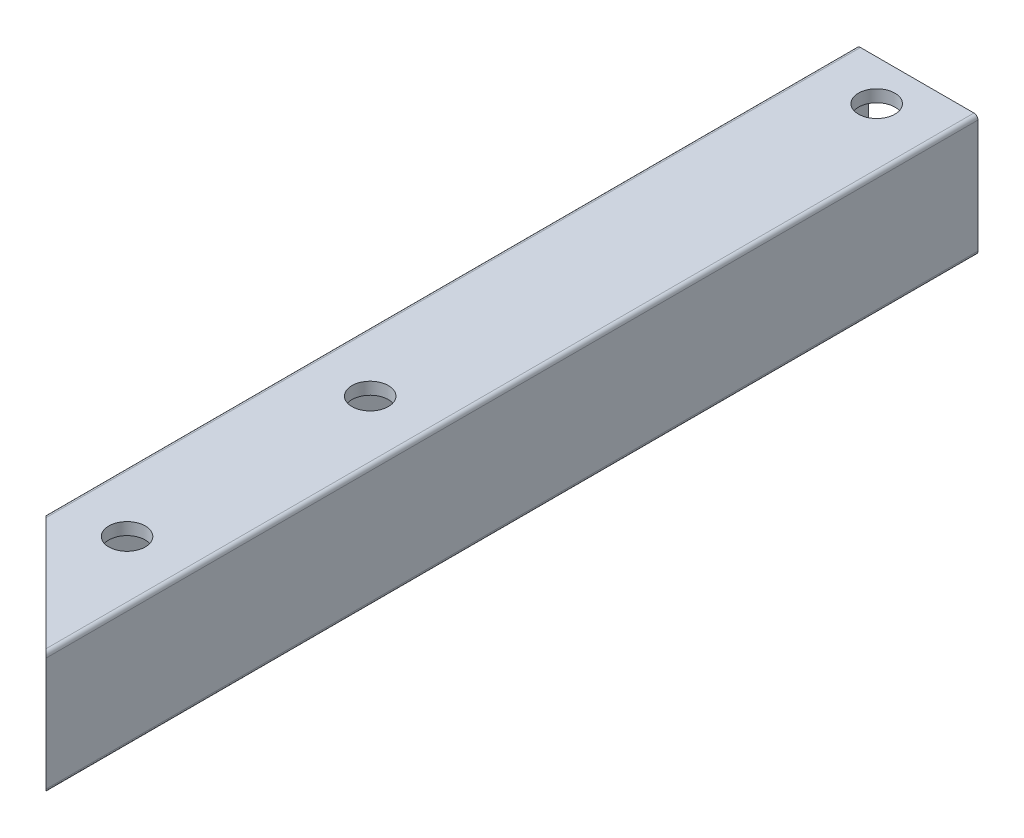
ISO-10303-21;
HEADER;
FILE_DESCRIPTION(('STEP AP214'),'2;1');
FILE_NAME('part.step','',(''),(''),'','','');
FILE_SCHEMA(('AUTOMOTIVE_DESIGN { 1 0 10303 214 1 1 1 1 }'));
ENDSEC;
DATA;
#1=APPLICATION_CONTEXT('core data for automotive mechanical design processes');
#2=APPLICATION_PROTOCOL_DEFINITION('international standard','automotive_design',2000,#1);
#3=PRODUCT_CONTEXT('',#1,'mechanical');
#4=PRODUCT('Part','Part','',(#3));
#5=PRODUCT_RELATED_PRODUCT_CATEGORY('part','',(#4));
#6=PRODUCT_DEFINITION_FORMATION('','',#4);
#7=PRODUCT_DEFINITION_CONTEXT('part definition',#1,'design');
#8=PRODUCT_DEFINITION('design','',#6,#7);
#9=PRODUCT_DEFINITION_SHAPE('','',#8);
#10=(LENGTH_UNIT() NAMED_UNIT(*) SI_UNIT(.MILLI.,.METRE.));
#11=(NAMED_UNIT(*) PLANE_ANGLE_UNIT() SI_UNIT($,.RADIAN.));
#12=(NAMED_UNIT(*) SI_UNIT($,.STERADIAN.) SOLID_ANGLE_UNIT());
#13=UNCERTAINTY_MEASURE_WITH_UNIT(LENGTH_MEASURE(1.E-05),#10,'distance_accuracy_value','');
#14=(GEOMETRIC_REPRESENTATION_CONTEXT(3) GLOBAL_UNCERTAINTY_ASSIGNED_CONTEXT((#13)) GLOBAL_UNIT_ASSIGNED_CONTEXT((#10,
#11,#12)) REPRESENTATION_CONTEXT('',''));
#15=CARTESIAN_POINT('',(0.,0.,0.));
#16=DIRECTION('',(0.,0.,1.));
#17=DIRECTION('',(1.,0.,0.));
#18=AXIS2_PLACEMENT_3D('',#15,#16,#17);
#19=CARTESIAN_POINT('',(-14.,-14.,230.));
#20=DIRECTION('',(0.,0.,-1.));
#21=DIRECTION('',(-1.,0.,0.));
#22=AXIS2_PLACEMENT_3D('',#19,#20,#21);
#23=CYLINDRICAL_SURFACE('',#22,0.999999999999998);
#24=CARTESIAN_POINT('',(-14.,-14.,201.));
#25=DIRECTION('',(0.707106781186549,0.,-0.707106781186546));
#26=DIRECTION('',(-0.707106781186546,0.,-0.707106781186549));
#27=AXIS2_PLACEMENT_3D('',#24,#25,#26);
#28=ELLIPSE('',#27,1.4142135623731,0.999999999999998);
#29=CARTESIAN_POINT('',(-15.,-14.,200.));
#30=VERTEX_POINT('',#29);
#31=CARTESIAN_POINT('',(-14.,-15.,201.));
#32=VERTEX_POINT('',#31);
#33=EDGE_CURVE('E117',#30,#32,#28,.F.);
#34=ORIENTED_EDGE('',*,*,#33,.F.);
#35=DIRECTION('',(0.,0.,-1.));
#36=VECTOR('',#35,1.);
#37=CARTESIAN_POINT('',(-15.,-14.,230.));
#38=LINE('',#37,#36);
#39=CARTESIAN_POINT('',(-15.,-14.,0.));
#40=VERTEX_POINT('',#39);
#41=EDGE_CURVE('E157',#30,#40,#38,.T.);
#42=ORIENTED_EDGE('',*,*,#41,.T.);
#43=CARTESIAN_POINT('',(-14.,-14.,0.));
#44=DIRECTION('',(0.,0.,-1.));
#45=DIRECTION('',(-1.,0.,0.));
#46=AXIS2_PLACEMENT_3D('',#43,#44,#45);
#47=CIRCLE('',#46,0.999999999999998);
#48=CARTESIAN_POINT('',(-14.,-15.,0.));
#49=VERTEX_POINT('',#48);
#50=EDGE_CURVE('E138',#49,#40,#47,.T.);
#51=ORIENTED_EDGE('',*,*,#50,.F.);
#52=DIRECTION('',(0.,0.,-1.));
#53=VECTOR('',#52,1.);
#54=CARTESIAN_POINT('',(-14.,-15.,230.));
#55=LINE('',#54,#53);
#56=EDGE_CURVE('E38',#32,#49,#55,.T.);
#57=ORIENTED_EDGE('',*,*,#56,.F.);
#58=EDGE_LOOP('',(#34,#42,#51,#57));
#59=FACE_BOUND('',#58,.T.);
#60=ADVANCED_FACE('F30',(#59),#23,.T.);
#61=CARTESIAN_POINT('',(14.,-15.,230.));
#62=DIRECTION('',(0.,-1.,0.));
#63=DIRECTION('',(1.,0.,0.));
#64=AXIS2_PLACEMENT_3D('',#61,#62,#63);
#65=PLANE('',#64);
#66=CARTESIAN_POINT('',(0.,-15.,10.));
#67=DIRECTION('',(0.,1.,0.));
#68=DIRECTION('',(0.,0.,1.));
#69=AXIS2_PLACEMENT_3D('',#66,#67,#68);
#70=CIRCLE('',#69,4.5);
#71=CARTESIAN_POINT('',(0.,-15.,14.5));
#72=VERTEX_POINT('',#71);
#73=EDGE_CURVE('E477',#72,#72,#70,.T.);
#74=ORIENTED_EDGE('',*,*,#73,.T.);
#75=EDGE_LOOP('',(#74));
#76=FACE_BOUND('',#75,.T.);
#77=CARTESIAN_POINT('',(0.,-15.,135.));
#78=DIRECTION('',(0.,-1.,0.));
#79=DIRECTION('',(1.,0.,0.));
#80=AXIS2_PLACEMENT_3D('',#77,#78,#79);
#81=CIRCLE('',#80,4.5);
#82=CARTESIAN_POINT('',(4.5,-15.,135.));
#83=VERTEX_POINT('',#82);
#84=EDGE_CURVE('E172',#83,#83,#81,.T.);
#85=ORIENTED_EDGE('',*,*,#84,.F.);
#86=EDGE_LOOP('',(#85));
#87=FACE_BOUND('',#86,.T.);
#88=CARTESIAN_POINT('',(0.,-15.,195.));
#89=DIRECTION('',(0.,-1.,0.));
#90=DIRECTION('',(1.,0.,0.));
#91=AXIS2_PLACEMENT_3D('',#88,#89,#90);
#92=CIRCLE('',#91,4.5);
#93=CARTESIAN_POINT('',(4.5,-15.,195.));
#94=VERTEX_POINT('',#93);
#95=EDGE_CURVE('E169',#94,#94,#92,.T.);
#96=ORIENTED_EDGE('',*,*,#95,.F.);
#97=EDGE_LOOP('',(#96));
#98=FACE_BOUND('',#97,.T.);
#99=DIRECTION('',(0.707106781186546,0.,0.707106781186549));
#100=VECTOR('',#99,1.);
#101=CARTESIAN_POINT('',(17.5,-15.,232.5));
#102=LINE('',#101,#100);
#103=CARTESIAN_POINT('',(14.,-15.,229.));
#104=VERTEX_POINT('',#103);
#105=EDGE_CURVE('E120',#32,#104,#102,.T.);
#106=ORIENTED_EDGE('',*,*,#105,.F.);
#107=ORIENTED_EDGE('',*,*,#56,.T.);
#108=DIRECTION('',(-1.,0.,0.));
#109=VECTOR('',#108,1.);
#110=CARTESIAN_POINT('',(14.,-15.,0.));
#111=LINE('',#110,#109);
#112=CARTESIAN_POINT('',(14.,-15.,0.));
#113=VERTEX_POINT('',#112);
#114=EDGE_CURVE('E238',#113,#49,#111,.T.);
#115=ORIENTED_EDGE('',*,*,#114,.F.);
#116=DIRECTION('',(0.,0.,-1.));
#117=VECTOR('',#116,1.);
#118=CARTESIAN_POINT('',(14.,-15.,230.));
#119=LINE('',#118,#117);
#120=EDGE_CURVE('E133',#104,#113,#119,.T.);
#121=ORIENTED_EDGE('',*,*,#120,.F.);
#122=EDGE_LOOP('',(#106,#107,#115,#121));
#123=FACE_BOUND('',#122,.T.);
#124=ADVANCED_FACE('F130',(#76,#87,#98,#123),#65,.T.);
#125=CARTESIAN_POINT('',(14.,-14.,230.));
#126=DIRECTION('',(0.,0.,-1.));
#127=DIRECTION('',(-1.,0.,0.));
#128=AXIS2_PLACEMENT_3D('',#125,#126,#127);
#129=CYLINDRICAL_SURFACE('',#128,1.);
#130=CARTESIAN_POINT('',(14.,-14.,229.));
#131=DIRECTION('',(0.707106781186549,0.,-0.707106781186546));
#132=DIRECTION('',(-0.707106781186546,0.,-0.707106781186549));
#133=AXIS2_PLACEMENT_3D('',#130,#131,#132);
#134=ELLIPSE('',#133,1.4142135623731,1.);
#135=CARTESIAN_POINT('',(15.,-14.,230.));
#136=VERTEX_POINT('',#135);
#137=EDGE_CURVE('E199',#104,#136,#134,.F.);
#138=ORIENTED_EDGE('',*,*,#137,.F.);
#139=ORIENTED_EDGE('',*,*,#120,.T.);
#140=CARTESIAN_POINT('',(14.,-14.,0.));
#141=DIRECTION('',(0.,0.,-1.));
#142=DIRECTION('',(-1.,0.,0.));
#143=AXIS2_PLACEMENT_3D('',#140,#141,#142);
#144=CIRCLE('',#143,1.);
#145=CARTESIAN_POINT('',(15.,-14.,0.));
#146=VERTEX_POINT('',#145);
#147=EDGE_CURVE('E236',#146,#113,#144,.T.);
#148=ORIENTED_EDGE('',*,*,#147,.F.);
#149=DIRECTION('',(0.,0.,-1.));
#150=VECTOR('',#149,1.);
#151=CARTESIAN_POINT('',(15.,-14.,230.));
#152=LINE('',#151,#150);
#153=EDGE_CURVE('E141',#136,#146,#152,.T.);
#154=ORIENTED_EDGE('',*,*,#153,.F.);
#155=EDGE_LOOP('',(#138,#139,#148,#154));
#156=FACE_BOUND('',#155,.T.);
#157=ADVANCED_FACE('F253',(#156),#129,.T.);
#158=CARTESIAN_POINT('',(15.,-14.,230.));
#159=DIRECTION('',(-1.,0.,0.));
#160=DIRECTION('',(0.,-1.,0.));
#161=AXIS2_PLACEMENT_3D('',#158,#159,#160);
#162=PLANE('',#161);
#163=DIRECTION('',(0.,1.,0.));
#164=VECTOR('',#163,1.);
#165=CARTESIAN_POINT('',(15.,-14.,0.));
#166=LINE('',#165,#164);
#167=CARTESIAN_POINT('',(15.,14.,0.));
#168=VERTEX_POINT('',#167);
#169=EDGE_CURVE('E234',#146,#168,#166,.T.);
#170=ORIENTED_EDGE('',*,*,#169,.T.);
#171=DIRECTION('',(0.,0.,-1.));
#172=VECTOR('',#171,1.);
#173=CARTESIAN_POINT('',(15.,14.,230.));
#174=LINE('',#173,#172);
#175=CARTESIAN_POINT('',(15.,14.,230.));
#176=VERTEX_POINT('',#175);
#177=EDGE_CURVE('E148',#176,#168,#174,.T.);
#178=ORIENTED_EDGE('',*,*,#177,.F.);
#179=DIRECTION('',(0.,1.,0.));
#180=VECTOR('',#179,1.);
#181=CARTESIAN_POINT('',(15.,-14.,230.));
#182=LINE('',#181,#180);
#183=EDGE_CURVE('E144',#136,#176,#182,.T.);
#184=ORIENTED_EDGE('',*,*,#183,.F.);
#185=ORIENTED_EDGE('',*,*,#153,.T.);
#186=EDGE_LOOP('',(#170,#178,#184,#185));
#187=FACE_BOUND('',#186,.T.);
#188=ADVANCED_FACE('F248',(#187),#162,.F.);
#189=CARTESIAN_POINT('',(14.,14.,230.));
#190=DIRECTION('',(0.,0.,-1.));
#191=DIRECTION('',(-1.,0.,0.));
#192=AXIS2_PLACEMENT_3D('',#189,#190,#191);
#193=CYLINDRICAL_SURFACE('',#192,0.999999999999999);
#194=DIRECTION('',(0.,0.,-1.));
#195=VECTOR('',#194,1.);
#196=CARTESIAN_POINT('',(14.,15.,230.));
#197=LINE('',#196,#195);
#198=CARTESIAN_POINT('',(14.,15.,229.));
#199=VERTEX_POINT('',#198);
#200=CARTESIAN_POINT('',(14.,15.,0.));
#201=VERTEX_POINT('',#200);
#202=EDGE_CURVE('E151',#199,#201,#197,.T.);
#203=ORIENTED_EDGE('',*,*,#202,.F.);
#204=CARTESIAN_POINT('',(14.,14.,229.));
#205=DIRECTION('',(0.707106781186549,0.,-0.707106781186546));
#206=DIRECTION('',(-0.707106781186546,0.,-0.707106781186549));
#207=AXIS2_PLACEMENT_3D('',#204,#205,#206);
#208=ELLIPSE('',#207,1.4142135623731,0.999999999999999);
#209=EDGE_CURVE('E126',#199,#176,#208,.T.);
#210=ORIENTED_EDGE('',*,*,#209,.T.);
#211=ORIENTED_EDGE('',*,*,#177,.T.);
#212=CARTESIAN_POINT('',(14.,14.,0.));
#213=DIRECTION('',(0.,0.,1.));
#214=DIRECTION('',(1.,0.,0.));
#215=AXIS2_PLACEMENT_3D('',#212,#213,#214);
#216=CIRCLE('',#215,0.999999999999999);
#217=EDGE_CURVE('E231',#168,#201,#216,.T.);
#218=ORIENTED_EDGE('',*,*,#217,.T.);
#219=EDGE_LOOP('',(#203,#210,#211,#218));
#220=FACE_BOUND('',#219,.T.);
#221=ADVANCED_FACE('F246',(#220),#193,.T.);
#222=CARTESIAN_POINT('',(-14.,15.,230.));
#223=DIRECTION('',(0.,1.,0.));
#224=DIRECTION('',(0.,0.,1.));
#225=AXIS2_PLACEMENT_3D('',#222,#223,#224);
#226=PLANE('',#225);
#227=CARTESIAN_POINT('',(0.,15.,10.));
#228=DIRECTION('',(0.,1.,0.));
#229=DIRECTION('',(0.,0.,1.));
#230=AXIS2_PLACEMENT_3D('',#227,#228,#229);
#231=CIRCLE('',#230,4.5);
#232=CARTESIAN_POINT('',(0.,15.,14.5));
#233=VERTEX_POINT('',#232);
#234=EDGE_CURVE('E483',#233,#233,#231,.T.);
#235=ORIENTED_EDGE('',*,*,#234,.F.);
#236=EDGE_LOOP('',(#235));
#237=FACE_BOUND('',#236,.T.);
#238=CARTESIAN_POINT('',(0.,15.,135.));
#239=DIRECTION('',(0.,-1.,0.));
#240=DIRECTION('',(1.,0.,0.));
#241=AXIS2_PLACEMENT_3D('',#238,#239,#240);
#242=CIRCLE('',#241,4.5);
#243=CARTESIAN_POINT('',(4.5,15.,135.));
#244=VERTEX_POINT('',#243);
#245=EDGE_CURVE('E165',#244,#244,#242,.T.);
#246=ORIENTED_EDGE('',*,*,#245,.T.);
#247=EDGE_LOOP('',(#246));
#248=FACE_BOUND('',#247,.T.);
#249=CARTESIAN_POINT('',(0.,15.,195.));
#250=DIRECTION('',(0.,-1.,0.));
#251=DIRECTION('',(1.,0.,0.));
#252=AXIS2_PLACEMENT_3D('',#249,#250,#251);
#253=CIRCLE('',#252,4.5);
#254=CARTESIAN_POINT('',(4.5,15.,195.));
#255=VERTEX_POINT('',#254);
#256=EDGE_CURVE('E161',#255,#255,#253,.T.);
#257=ORIENTED_EDGE('',*,*,#256,.T.);
#258=EDGE_LOOP('',(#257));
#259=FACE_BOUND('',#258,.T.);
#260=DIRECTION('',(0.707106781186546,0.,0.707106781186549));
#261=VECTOR('',#260,1.);
#262=CARTESIAN_POINT('',(17.5,15.,232.5));
#263=LINE('',#262,#261);
#264=CARTESIAN_POINT('',(-14.,15.,201.));
#265=VERTEX_POINT('',#264);
#266=EDGE_CURVE('E134',#265,#199,#263,.T.);
#267=ORIENTED_EDGE('',*,*,#266,.T.);
#268=ORIENTED_EDGE('',*,*,#202,.T.);
#269=DIRECTION('',(1.,0.,0.));
#270=VECTOR('',#269,1.);
#271=CARTESIAN_POINT('',(-14.,15.,0.));
#272=LINE('',#271,#270);
#273=CARTESIAN_POINT('',(-14.,15.,0.));
#274=VERTEX_POINT('',#273);
#275=EDGE_CURVE('E228',#274,#201,#272,.T.);
#276=ORIENTED_EDGE('',*,*,#275,.F.);
#277=DIRECTION('',(0.,0.,-1.));
#278=VECTOR('',#277,1.);
#279=CARTESIAN_POINT('',(-14.,15.,230.));
#280=LINE('',#279,#278);
#281=EDGE_CURVE('E153',#265,#274,#280,.T.);
#282=ORIENTED_EDGE('',*,*,#281,.F.);
#283=EDGE_LOOP('',(#267,#268,#276,#282));
#284=FACE_BOUND('',#283,.T.);
#285=ADVANCED_FACE('F283',(#237,#248,#259,#284),#226,.T.);
#286=CARTESIAN_POINT('',(-14.,14.,230.));
#287=DIRECTION('',(0.,0.,-1.));
#288=DIRECTION('',(-1.,0.,0.));
#289=AXIS2_PLACEMENT_3D('',#286,#287,#288);
#290=CYLINDRICAL_SURFACE('',#289,0.999999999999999);
#291=CARTESIAN_POINT('',(-14.,14.,201.));
#292=DIRECTION('',(0.707106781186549,0.,-0.707106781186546));
#293=DIRECTION('',(-0.707106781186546,0.,-0.707106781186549));
#294=AXIS2_PLACEMENT_3D('',#291,#292,#293);
#295=ELLIPSE('',#294,1.4142135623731,0.999999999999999);
#296=CARTESIAN_POINT('',(-15.,14.,200.));
#297=VERTEX_POINT('',#296);
#298=EDGE_CURVE('E46',#265,#297,#295,.F.);
#299=ORIENTED_EDGE('',*,*,#298,.F.);
#300=ORIENTED_EDGE('',*,*,#281,.T.);
#301=CARTESIAN_POINT('',(-14.,14.,0.));
#302=DIRECTION('',(0.,0.,-1.));
#303=DIRECTION('',(-1.,0.,0.));
#304=AXIS2_PLACEMENT_3D('',#301,#302,#303);
#305=CIRCLE('',#304,0.999999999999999);
#306=CARTESIAN_POINT('',(-15.,14.,0.));
#307=VERTEX_POINT('',#306);
#308=EDGE_CURVE('E225',#307,#274,#305,.T.);
#309=ORIENTED_EDGE('',*,*,#308,.F.);
#310=DIRECTION('',(0.,0.,-1.));
#311=VECTOR('',#310,1.);
#312=CARTESIAN_POINT('',(-15.,14.,230.));
#313=LINE('',#312,#311);
#314=EDGE_CURVE('E155',#297,#307,#313,.T.);
#315=ORIENTED_EDGE('',*,*,#314,.F.);
#316=EDGE_LOOP('',(#299,#300,#309,#315));
#317=FACE_BOUND('',#316,.T.);
#318=ADVANCED_FACE('F288',(#317),#290,.T.);
#319=CARTESIAN_POINT('',(-15.,14.,230.));
#320=DIRECTION('',(1.,0.,0.));
#321=DIRECTION('',(0.,1.,0.));
#322=AXIS2_PLACEMENT_3D('',#319,#320,#321);
#323=PLANE('',#322);
#324=ORIENTED_EDGE('',*,*,#41,.F.);
#325=DIRECTION('',(0.,1.,0.));
#326=VECTOR('',#325,1.);
#327=CARTESIAN_POINT('',(-15.,14.,200.));
#328=LINE('',#327,#326);
#329=EDGE_CURVE('E122',#30,#297,#328,.T.);
#330=ORIENTED_EDGE('',*,*,#329,.T.);
#331=ORIENTED_EDGE('',*,*,#314,.T.);
#332=DIRECTION('',(0.,-1.,0.));
#333=VECTOR('',#332,1.);
#334=CARTESIAN_POINT('',(-15.,14.,0.));
#335=LINE('',#334,#333);
#336=EDGE_CURVE('E222',#307,#40,#335,.T.);
#337=ORIENTED_EDGE('',*,*,#336,.T.);
#338=EDGE_LOOP('',(#324,#330,#331,#337));
#339=FACE_BOUND('',#338,.T.);
#340=ADVANCED_FACE('F361',(#339),#323,.F.);
#341=CARTESIAN_POINT('',(-14.,-14.,0.));
#342=DIRECTION('',(0.,0.,-1.));
#343=DIRECTION('',(-1.,0.,0.));
#344=AXIS2_PLACEMENT_3D('',#341,#342,#343);
#345=PLANE('',#344);
#346=DIRECTION('',(-1.,0.,0.));
#347=VECTOR('',#346,1.);
#348=CARTESIAN_POINT('',(-14.,-12.,0.));
#349=LINE('',#348,#347);
#350=CARTESIAN_POINT('',(12.,-12.,0.));
#351=VERTEX_POINT('',#350);
#352=CARTESIAN_POINT('',(-12.,-12.,0.));
#353=VERTEX_POINT('',#352);
#354=EDGE_CURVE('E204',#351,#353,#349,.T.);
#355=ORIENTED_EDGE('',*,*,#354,.F.);
#356=DIRECTION('',(0.,1.,0.));
#357=VECTOR('',#356,1.);
#358=CARTESIAN_POINT('',(12.,-14.,0.));
#359=LINE('',#358,#357);
#360=CARTESIAN_POINT('',(12.,12.,0.));
#361=VERTEX_POINT('',#360);
#362=EDGE_CURVE('E207',#351,#361,#359,.T.);
#363=ORIENTED_EDGE('',*,*,#362,.T.);
#364=DIRECTION('',(1.,0.,0.));
#365=VECTOR('',#364,1.);
#366=CARTESIAN_POINT('',(-14.,12.,0.));
#367=LINE('',#366,#365);
#368=CARTESIAN_POINT('',(-12.,12.,0.));
#369=VERTEX_POINT('',#368);
#370=EDGE_CURVE('E210',#369,#361,#367,.T.);
#371=ORIENTED_EDGE('',*,*,#370,.F.);
#372=DIRECTION('',(0.,-1.,0.));
#373=VECTOR('',#372,1.);
#374=CARTESIAN_POINT('',(-12.,-14.,0.));
#375=LINE('',#374,#373);
#376=EDGE_CURVE('E201',#369,#353,#375,.T.);
#377=ORIENTED_EDGE('',*,*,#376,.T.);
#378=EDGE_LOOP('',(#355,#363,#371,#377));
#379=FACE_BOUND('',#378,.T.);
#380=ORIENTED_EDGE('',*,*,#50,.T.);
#381=ORIENTED_EDGE('',*,*,#336,.F.);
#382=ORIENTED_EDGE('',*,*,#308,.T.);
#383=ORIENTED_EDGE('',*,*,#275,.T.);
#384=ORIENTED_EDGE('',*,*,#217,.F.);
#385=ORIENTED_EDGE('',*,*,#169,.F.);
#386=ORIENTED_EDGE('',*,*,#147,.T.);
#387=ORIENTED_EDGE('',*,*,#114,.T.);
#388=EDGE_LOOP('',(#380,#381,#382,#383,#384,#385,#386,#387));
#389=FACE_BOUND('',#388,.T.);
#390=ADVANCED_FACE('F251',(#379,#389),#345,.T.);
#391=CARTESIAN_POINT('',(-12.,-14.,230.));
#392=DIRECTION('',(1.,0.,0.));
#393=DIRECTION('',(0.,1.,0.));
#394=AXIS2_PLACEMENT_3D('',#391,#392,#393);
#395=PLANE('',#394);
#396=DIRECTION('',(0.,1.,0.));
#397=VECTOR('',#396,1.);
#398=CARTESIAN_POINT('',(-12.,-14.,203.));
#399=LINE('',#398,#397);
#400=CARTESIAN_POINT('',(-12.,-12.,203.));
#401=VERTEX_POINT('',#400);
#402=CARTESIAN_POINT('',(-12.,12.,203.));
#403=VERTEX_POINT('',#402);
#404=EDGE_CURVE('E54',#401,#403,#399,.T.);
#405=ORIENTED_EDGE('',*,*,#404,.F.);
#406=DIRECTION('',(0.,0.,-1.));
#407=VECTOR('',#406,1.);
#408=CARTESIAN_POINT('',(-12.,-12.,230.));
#409=LINE('',#408,#407);
#410=EDGE_CURVE('E219',#401,#353,#409,.T.);
#411=ORIENTED_EDGE('',*,*,#410,.T.);
#412=ORIENTED_EDGE('',*,*,#376,.F.);
#413=DIRECTION('',(0.,0.,-1.));
#414=VECTOR('',#413,1.);
#415=CARTESIAN_POINT('',(-12.,12.,230.));
#416=LINE('',#415,#414);
#417=EDGE_CURVE('E213',#403,#369,#416,.T.);
#418=ORIENTED_EDGE('',*,*,#417,.F.);
#419=EDGE_LOOP('',(#405,#411,#412,#418));
#420=FACE_BOUND('',#419,.T.);
#421=ADVANCED_FACE('F304',(#420),#395,.T.);
#422=CARTESIAN_POINT('',(-14.,-12.,230.));
#423=DIRECTION('',(0.,-1.,0.));
#424=DIRECTION('',(1.,0.,0.));
#425=AXIS2_PLACEMENT_3D('',#422,#423,#424);
#426=PLANE('',#425);
#427=CARTESIAN_POINT('',(0.,-12.,10.));
#428=DIRECTION('',(0.,-1.,0.));
#429=DIRECTION('',(1.,0.,0.));
#430=AXIS2_PLACEMENT_3D('',#427,#428,#429);
#431=CIRCLE('',#430,4.5);
#432=CARTESIAN_POINT('',(4.5,-12.,10.));
#433=VERTEX_POINT('',#432);
#434=EDGE_CURVE('E177',#433,#433,#431,.T.);
#435=ORIENTED_EDGE('',*,*,#434,.T.);
#436=EDGE_LOOP('',(#435));
#437=FACE_BOUND('',#436,.T.);
#438=CARTESIAN_POINT('',(0.,-12.,135.));
#439=DIRECTION('',(0.,-1.,0.));
#440=DIRECTION('',(1.,0.,0.));
#441=AXIS2_PLACEMENT_3D('',#438,#439,#440);
#442=CIRCLE('',#441,4.5);
#443=CARTESIAN_POINT('',(4.5,-12.,135.));
#444=VERTEX_POINT('',#443);
#445=EDGE_CURVE('E164',#444,#444,#442,.T.);
#446=ORIENTED_EDGE('',*,*,#445,.T.);
#447=EDGE_LOOP('',(#446));
#448=FACE_BOUND('',#447,.T.);
#449=CARTESIAN_POINT('',(0.,-12.,195.));
#450=DIRECTION('',(0.,-1.,0.));
#451=DIRECTION('',(1.,0.,0.));
#452=AXIS2_PLACEMENT_3D('',#449,#450,#451);
#453=CIRCLE('',#452,4.5);
#454=CARTESIAN_POINT('',(4.5,-12.,195.));
#455=VERTEX_POINT('',#454);
#456=EDGE_CURVE('E135',#455,#455,#453,.T.);
#457=ORIENTED_EDGE('',*,*,#456,.T.);
#458=EDGE_LOOP('',(#457));
#459=FACE_BOUND('',#458,.T.);
#460=ORIENTED_EDGE('',*,*,#410,.F.);
#461=DIRECTION('',(0.707106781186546,0.,0.707106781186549));
#462=VECTOR('',#461,1.);
#463=CARTESIAN_POINT('',(0.50000000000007,-12.,215.5));
#464=LINE('',#463,#462);
#465=CARTESIAN_POINT('',(12.,-12.,227.));
#466=VERTEX_POINT('',#465);
#467=EDGE_CURVE('E191',#401,#466,#464,.T.);
#468=ORIENTED_EDGE('',*,*,#467,.T.);
#469=DIRECTION('',(0.,0.,-1.));
#470=VECTOR('',#469,1.);
#471=CARTESIAN_POINT('',(12.,-12.,230.));
#472=LINE('',#471,#470);
#473=EDGE_CURVE('E217',#466,#351,#472,.T.);
#474=ORIENTED_EDGE('',*,*,#473,.T.);
#475=ORIENTED_EDGE('',*,*,#354,.T.);
#476=EDGE_LOOP('',(#460,#468,#474,#475));
#477=FACE_BOUND('',#476,.T.);
#478=ADVANCED_FACE('F298',(#437,#448,#459,#477),#426,.F.);
#479=CARTESIAN_POINT('',(12.,-14.,230.));
#480=DIRECTION('',(-1.,0.,0.));
#481=DIRECTION('',(0.,-1.,0.));
#482=AXIS2_PLACEMENT_3D('',#479,#480,#481);
#483=PLANE('',#482);
#484=DIRECTION('',(0.,-1.,0.));
#485=VECTOR('',#484,1.);
#486=CARTESIAN_POINT('',(12.,-14.,227.));
#487=LINE('',#486,#485);
#488=CARTESIAN_POINT('',(12.,12.,227.));
#489=VERTEX_POINT('',#488);
#490=EDGE_CURVE('E189',#489,#466,#487,.T.);
#491=ORIENTED_EDGE('',*,*,#490,.F.);
#492=DIRECTION('',(0.,0.,-1.));
#493=VECTOR('',#492,1.);
#494=CARTESIAN_POINT('',(12.,12.,230.));
#495=LINE('',#494,#493);
#496=EDGE_CURVE('E215',#489,#361,#495,.T.);
#497=ORIENTED_EDGE('',*,*,#496,.T.);
#498=ORIENTED_EDGE('',*,*,#362,.F.);
#499=ORIENTED_EDGE('',*,*,#473,.F.);
#500=EDGE_LOOP('',(#491,#497,#498,#499));
#501=FACE_BOUND('',#500,.T.);
#502=ADVANCED_FACE('F303',(#501),#483,.T.);
#503=CARTESIAN_POINT('',(-14.,12.,230.));
#504=DIRECTION('',(0.,1.,0.));
#505=DIRECTION('',(0.,0.,1.));
#506=AXIS2_PLACEMENT_3D('',#503,#504,#505);
#507=PLANE('',#506);
#508=CARTESIAN_POINT('',(0.,12.,10.));
#509=DIRECTION('',(0.,1.,0.));
#510=DIRECTION('',(0.,0.,1.));
#511=AXIS2_PLACEMENT_3D('',#508,#509,#510);
#512=CIRCLE('',#511,4.5);
#513=CARTESIAN_POINT('',(0.,12.,14.5));
#514=VERTEX_POINT('',#513);
#515=EDGE_CURVE('E33',#514,#514,#512,.T.);
#516=ORIENTED_EDGE('',*,*,#515,.T.);
#517=EDGE_LOOP('',(#516));
#518=FACE_BOUND('',#517,.T.);
#519=CARTESIAN_POINT('',(0.,12.,135.));
#520=DIRECTION('',(0.,1.,0.));
#521=DIRECTION('',(0.,0.,1.));
#522=AXIS2_PLACEMENT_3D('',#519,#520,#521);
#523=CIRCLE('',#522,4.5);
#524=CARTESIAN_POINT('',(4.5,12.,135.));
#525=VERTEX_POINT('',#524);
#526=EDGE_CURVE('E162',#525,#525,#523,.T.);
#527=ORIENTED_EDGE('',*,*,#526,.T.);
#528=EDGE_LOOP('',(#527));
#529=FACE_BOUND('',#528,.T.);
#530=CARTESIAN_POINT('',(0.,12.,195.));
#531=DIRECTION('',(0.,1.,0.));
#532=DIRECTION('',(0.,0.,1.));
#533=AXIS2_PLACEMENT_3D('',#530,#531,#532);
#534=CIRCLE('',#533,4.5);
#535=CARTESIAN_POINT('',(4.5,12.,195.));
#536=VERTEX_POINT('',#535);
#537=EDGE_CURVE('E159',#536,#536,#534,.T.);
#538=ORIENTED_EDGE('',*,*,#537,.T.);
#539=EDGE_LOOP('',(#538));
#540=FACE_BOUND('',#539,.T.);
#541=ORIENTED_EDGE('',*,*,#496,.F.);
#542=DIRECTION('',(-0.707106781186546,0.,-0.707106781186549));
#543=VECTOR('',#542,1.);
#544=CARTESIAN_POINT('',(0.50000000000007,12.,215.5));
#545=LINE('',#544,#543);
#546=EDGE_CURVE('E11',#489,#403,#545,.T.);
#547=ORIENTED_EDGE('',*,*,#546,.T.);
#548=ORIENTED_EDGE('',*,*,#417,.T.);
#549=ORIENTED_EDGE('',*,*,#370,.T.);
#550=EDGE_LOOP('',(#541,#547,#548,#549));
#551=FACE_BOUND('',#550,.T.);
#552=ADVANCED_FACE('F314',(#518,#529,#540,#551),#507,.F.);
#553=CARTESIAN_POINT('',(17.5,15.,232.5));
#554=DIRECTION('',(0.707106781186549,0.,-0.707106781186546));
#555=DIRECTION('',(-0.707106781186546,0.,-0.707106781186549));
#556=AXIS2_PLACEMENT_3D('',#553,#554,#555);
#557=PLANE('',#556);
#558=ORIENTED_EDGE('',*,*,#137,.T.);
#559=ORIENTED_EDGE('',*,*,#183,.T.);
#560=ORIENTED_EDGE('',*,*,#209,.F.);
#561=ORIENTED_EDGE('',*,*,#266,.F.);
#562=ORIENTED_EDGE('',*,*,#298,.T.);
#563=ORIENTED_EDGE('',*,*,#329,.F.);
#564=ORIENTED_EDGE('',*,*,#33,.T.);
#565=ORIENTED_EDGE('',*,*,#105,.T.);
#566=EDGE_LOOP('',(#558,#559,#560,#561,#562,#563,#564,#565));
#567=FACE_BOUND('',#566,.T.);
#568=ORIENTED_EDGE('',*,*,#404,.T.);
#569=ORIENTED_EDGE('',*,*,#546,.F.);
#570=ORIENTED_EDGE('',*,*,#490,.T.);
#571=ORIENTED_EDGE('',*,*,#467,.F.);
#572=EDGE_LOOP('',(#568,#569,#570,#571));
#573=FACE_BOUND('',#572,.T.);
#574=ADVANCED_FACE('F119',(#567,#573),#557,.F.);
#575=CARTESIAN_POINT('',(0.,15.,195.));
#576=DIRECTION('',(0.,-1.,0.));
#577=DIRECTION('',(1.,0.,0.));
#578=AXIS2_PLACEMENT_3D('',#575,#576,#577);
#579=CYLINDRICAL_SURFACE('',#578,4.5);
#580=CARTESIAN_POINT('',(4.5,15.,195.));
#581=CARTESIAN_POINT('',(4.5,14.96875,195.));
#582=CARTESIAN_POINT('',(4.5,14.9375,195.));
#583=CARTESIAN_POINT('',(4.5,14.875,195.));
#584=CARTESIAN_POINT('',(4.5,14.84375,195.));
#585=CARTESIAN_POINT('',(4.5,14.78125,195.));
#586=CARTESIAN_POINT('',(4.5,14.75,195.));
#587=CARTESIAN_POINT('',(4.5,14.6875,195.));
#588=CARTESIAN_POINT('',(4.5,14.65625,195.));
#589=CARTESIAN_POINT('',(4.5,14.59375,195.));
#590=CARTESIAN_POINT('',(4.5,14.5625,195.));
#591=CARTESIAN_POINT('',(4.5,14.5,195.));
#592=CARTESIAN_POINT('',(4.5,14.46875,195.));
#593=CARTESIAN_POINT('',(4.5,14.40625,195.));
#594=CARTESIAN_POINT('',(4.5,14.375,195.));
#595=CARTESIAN_POINT('',(4.5,14.3125,195.));
#596=CARTESIAN_POINT('',(4.5,14.28125,195.));
#597=CARTESIAN_POINT('',(4.5,14.21875,195.));
#598=CARTESIAN_POINT('',(4.5,14.1875,195.));
#599=CARTESIAN_POINT('',(4.5,14.125,195.));
#600=CARTESIAN_POINT('',(4.5,14.09375,195.));
#601=CARTESIAN_POINT('',(4.5,14.03125,195.));
#602=CARTESIAN_POINT('',(4.5,14.,195.));
#603=CARTESIAN_POINT('',(4.5,13.9375,195.));
#604=CARTESIAN_POINT('',(4.5,13.90625,195.));
#605=CARTESIAN_POINT('',(4.5,13.84375,195.));
#606=CARTESIAN_POINT('',(4.5,13.8125,195.));
#607=CARTESIAN_POINT('',(4.5,13.75,195.));
#608=CARTESIAN_POINT('',(4.5,13.71875,195.));
#609=CARTESIAN_POINT('',(4.5,13.65625,195.));
#610=CARTESIAN_POINT('',(4.5,13.625,195.));
#611=CARTESIAN_POINT('',(4.5,13.5625,195.));
#612=CARTESIAN_POINT('',(4.5,13.53125,195.));
#613=CARTESIAN_POINT('',(4.5,13.46875,195.));
#614=CARTESIAN_POINT('',(4.5,13.4375,195.));
#615=CARTESIAN_POINT('',(4.5,13.375,195.));
#616=CARTESIAN_POINT('',(4.5,13.34375,195.));
#617=CARTESIAN_POINT('',(4.5,13.28125,195.));
#618=CARTESIAN_POINT('',(4.5,13.25,195.));
#619=CARTESIAN_POINT('',(4.5,13.1875,195.));
#620=CARTESIAN_POINT('',(4.5,13.15625,195.));
#621=CARTESIAN_POINT('',(4.5,13.09375,195.));
#622=CARTESIAN_POINT('',(4.5,13.0625,195.));
#623=CARTESIAN_POINT('',(4.5,13.,195.));
#624=CARTESIAN_POINT('',(4.5,12.96875,195.));
#625=CARTESIAN_POINT('',(4.5,12.90625,195.));
#626=CARTESIAN_POINT('',(4.5,12.875,195.));
#627=CARTESIAN_POINT('',(4.5,12.8125,195.));
#628=CARTESIAN_POINT('',(4.5,12.78125,195.));
#629=CARTESIAN_POINT('',(4.5,12.71875,195.));
#630=CARTESIAN_POINT('',(4.5,12.6875,195.));
#631=CARTESIAN_POINT('',(4.5,12.625,195.));
#632=CARTESIAN_POINT('',(4.5,12.59375,195.));
#633=CARTESIAN_POINT('',(4.5,12.53125,195.));
#634=CARTESIAN_POINT('',(4.5,12.5,195.));
#635=CARTESIAN_POINT('',(4.5,12.4375,195.));
#636=CARTESIAN_POINT('',(4.5,12.40625,195.));
#637=CARTESIAN_POINT('',(4.5,12.34375,195.));
#638=CARTESIAN_POINT('',(4.5,12.3125,195.));
#639=CARTESIAN_POINT('',(4.5,12.25,195.));
#640=CARTESIAN_POINT('',(4.5,12.21875,195.));
#641=CARTESIAN_POINT('',(4.5,12.15625,195.));
#642=CARTESIAN_POINT('',(4.5,12.125,195.));
#643=CARTESIAN_POINT('',(4.5,12.0625,195.));
#644=CARTESIAN_POINT('',(4.5,12.03125,195.));
#645=CARTESIAN_POINT('',(4.5,12.,195.));
#646=B_SPLINE_CURVE_WITH_KNOTS('',3,(#580,#581,#582,#583,#584,#585,#586,#587,#588,#589,#590,
#591,#592,#593,#594,#595,#596,#597,#598,#599,#600,#601,#602,#603,#604,#605,#606,#607,#608,#609,
#610,#611,#612,#613,#614,#615,#616,#617,#618,#619,#620,#621,#622,#623,#624,#625,#626,#627,#628,
#629,#630,#631,#632,#633,#634,#635,#636,#637,#638,#639,#640,#641,#642,#643,#644,#645),
.UNSPECIFIED.,.F.,.F.,(4,2,2,2,2,2,2,2,2,2,2,2,2,2,2,2,2,2,2,2,2,2,2,2,2,2,2,2,2,2,2,2,4),(0.,
0.0937499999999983,0.187499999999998,0.281249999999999,0.374999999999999,0.468749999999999,
0.562499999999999,0.656249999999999,0.749999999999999,0.843749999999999,0.937499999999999,
1.03125,1.125,1.21875,1.3125,1.40625,1.5,1.59375,1.6875,1.78125,1.875,1.96875,2.0625,2.15625,
2.25,2.34375,2.4375,2.53125,2.625,2.71875,2.8125,2.90625,3.),.UNSPECIFIED.);
#647=EDGE_CURVE('BSEAM353',#255,#536,#646,.T.);
#648=ORIENTED_EDGE('',*,*,#256,.F.);
#649=ORIENTED_EDGE('',*,*,#537,.F.);
#650=ORIENTED_EDGE('',*,*,#647,.T.);
#651=ORIENTED_EDGE('',*,*,#647,.F.);
#652=EDGE_LOOP('',(#648,#650,#649,#651));
#653=FACE_BOUND('',#652,.T.);
#654=ADVANCED_FACE('F353',(#653),#579,.F.);
#655=CARTESIAN_POINT('',(4.5,-15.,195.));
#656=CARTESIAN_POINT('',(4.5,-14.96875,195.));
#657=CARTESIAN_POINT('',(4.5,-14.9375,195.));
#658=CARTESIAN_POINT('',(4.5,-14.875,195.));
#659=CARTESIAN_POINT('',(4.5,-14.84375,195.));
#660=CARTESIAN_POINT('',(4.5,-14.78125,195.));
#661=CARTESIAN_POINT('',(4.5,-14.75,195.));
#662=CARTESIAN_POINT('',(4.5,-14.6875,195.));
#663=CARTESIAN_POINT('',(4.5,-14.65625,195.));
#664=CARTESIAN_POINT('',(4.5,-14.59375,195.));
#665=CARTESIAN_POINT('',(4.5,-14.5625,195.));
#666=CARTESIAN_POINT('',(4.5,-14.5,195.));
#667=CARTESIAN_POINT('',(4.5,-14.46875,195.));
#668=CARTESIAN_POINT('',(4.5,-14.40625,195.));
#669=CARTESIAN_POINT('',(4.5,-14.375,195.));
#670=CARTESIAN_POINT('',(4.5,-14.3125,195.));
#671=CARTESIAN_POINT('',(4.5,-14.28125,195.));
#672=CARTESIAN_POINT('',(4.5,-14.21875,195.));
#673=CARTESIAN_POINT('',(4.5,-14.1875,195.));
#674=CARTESIAN_POINT('',(4.5,-14.125,195.));
#675=CARTESIAN_POINT('',(4.5,-14.09375,195.));
#676=CARTESIAN_POINT('',(4.5,-14.03125,195.));
#677=CARTESIAN_POINT('',(4.5,-14.,195.));
#678=CARTESIAN_POINT('',(4.5,-13.9375,195.));
#679=CARTESIAN_POINT('',(4.5,-13.90625,195.));
#680=CARTESIAN_POINT('',(4.5,-13.84375,195.));
#681=CARTESIAN_POINT('',(4.5,-13.8125,195.));
#682=CARTESIAN_POINT('',(4.5,-13.75,195.));
#683=CARTESIAN_POINT('',(4.5,-13.71875,195.));
#684=CARTESIAN_POINT('',(4.5,-13.65625,195.));
#685=CARTESIAN_POINT('',(4.5,-13.625,195.));
#686=CARTESIAN_POINT('',(4.5,-13.5625,195.));
#687=CARTESIAN_POINT('',(4.5,-13.53125,195.));
#688=CARTESIAN_POINT('',(4.5,-13.46875,195.));
#689=CARTESIAN_POINT('',(4.5,-13.4375,195.));
#690=CARTESIAN_POINT('',(4.5,-13.375,195.));
#691=CARTESIAN_POINT('',(4.5,-13.34375,195.));
#692=CARTESIAN_POINT('',(4.5,-13.28125,195.));
#693=CARTESIAN_POINT('',(4.5,-13.25,195.));
#694=CARTESIAN_POINT('',(4.5,-13.1875,195.));
#695=CARTESIAN_POINT('',(4.5,-13.15625,195.));
#696=CARTESIAN_POINT('',(4.5,-13.09375,195.));
#697=CARTESIAN_POINT('',(4.5,-13.0625,195.));
#698=CARTESIAN_POINT('',(4.5,-13.,195.));
#699=CARTESIAN_POINT('',(4.5,-12.96875,195.));
#700=CARTESIAN_POINT('',(4.5,-12.90625,195.));
#701=CARTESIAN_POINT('',(4.5,-12.875,195.));
#702=CARTESIAN_POINT('',(4.5,-12.8125,195.));
#703=CARTESIAN_POINT('',(4.5,-12.78125,195.));
#704=CARTESIAN_POINT('',(4.5,-12.71875,195.));
#705=CARTESIAN_POINT('',(4.5,-12.6875,195.));
#706=CARTESIAN_POINT('',(4.5,-12.625,195.));
#707=CARTESIAN_POINT('',(4.5,-12.59375,195.));
#708=CARTESIAN_POINT('',(4.5,-12.53125,195.));
#709=CARTESIAN_POINT('',(4.5,-12.5,195.));
#710=CARTESIAN_POINT('',(4.5,-12.4375,195.));
#711=CARTESIAN_POINT('',(4.5,-12.40625,195.));
#712=CARTESIAN_POINT('',(4.5,-12.34375,195.));
#713=CARTESIAN_POINT('',(4.5,-12.3125,195.));
#714=CARTESIAN_POINT('',(4.5,-12.25,195.));
#715=CARTESIAN_POINT('',(4.5,-12.21875,195.));
#716=CARTESIAN_POINT('',(4.5,-12.15625,195.));
#717=CARTESIAN_POINT('',(4.5,-12.125,195.));
#718=CARTESIAN_POINT('',(4.5,-12.0625,195.));
#719=CARTESIAN_POINT('',(4.5,-12.03125,195.));
#720=CARTESIAN_POINT('',(4.5,-12.,195.));
#721=B_SPLINE_CURVE_WITH_KNOTS('',3,(#655,#656,#657,#658,#659,#660,#661,#662,#663,#664,#665,
#666,#667,#668,#669,#670,#671,#672,#673,#674,#675,#676,#677,#678,#679,#680,#681,#682,#683,#684,
#685,#686,#687,#688,#689,#690,#691,#692,#693,#694,#695,#696,#697,#698,#699,#700,#701,#702,#703,
#704,#705,#706,#707,#708,#709,#710,#711,#712,#713,#714,#715,#716,#717,#718,#719,#720),
.UNSPECIFIED.,.F.,.F.,(4,2,2,2,2,2,2,2,2,2,2,2,2,2,2,2,2,2,2,2,2,2,2,2,2,2,2,2,2,2,2,2,4),(0.,
0.0937500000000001,0.1875,0.28125,0.375,0.46875,0.5625,0.656250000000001,0.750000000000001,
0.843749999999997,0.937499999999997,1.03125,1.125,1.21875,1.3125,1.40625,1.5,1.59375,1.6875,
1.78125,1.875,1.96875,2.0625,2.15625,2.25,2.34375,2.4375,2.53125,2.625,2.71875,2.8125,2.90625,
3.),.UNSPECIFIED.);
#722=EDGE_CURVE('BSEAM350',#94,#455,#721,.T.);
#723=ORIENTED_EDGE('',*,*,#95,.T.);
#724=ORIENTED_EDGE('',*,*,#456,.F.);
#725=ORIENTED_EDGE('',*,*,#722,.T.);
#726=ORIENTED_EDGE('',*,*,#722,.F.);
#727=EDGE_LOOP('',(#723,#725,#724,#726));
#728=FACE_BOUND('',#727,.T.);
#729=ADVANCED_FACE('F350',(#728),#579,.F.);
#730=CARTESIAN_POINT('',(0.,15.,135.));
#731=DIRECTION('',(0.,-1.,0.));
#732=DIRECTION('',(1.,0.,0.));
#733=AXIS2_PLACEMENT_3D('',#730,#731,#732);
#734=CYLINDRICAL_SURFACE('',#733,4.5);
#735=CARTESIAN_POINT('',(4.5,15.,135.));
#736=CARTESIAN_POINT('',(4.5,14.96875,135.));
#737=CARTESIAN_POINT('',(4.5,14.9375,135.));
#738=CARTESIAN_POINT('',(4.5,14.875,135.));
#739=CARTESIAN_POINT('',(4.5,14.84375,135.));
#740=CARTESIAN_POINT('',(4.5,14.78125,135.));
#741=CARTESIAN_POINT('',(4.5,14.75,135.));
#742=CARTESIAN_POINT('',(4.5,14.6875,135.));
#743=CARTESIAN_POINT('',(4.5,14.65625,135.));
#744=CARTESIAN_POINT('',(4.5,14.59375,135.));
#745=CARTESIAN_POINT('',(4.5,14.5625,135.));
#746=CARTESIAN_POINT('',(4.5,14.5,135.));
#747=CARTESIAN_POINT('',(4.5,14.46875,135.));
#748=CARTESIAN_POINT('',(4.5,14.40625,135.));
#749=CARTESIAN_POINT('',(4.5,14.375,135.));
#750=CARTESIAN_POINT('',(4.5,14.3125,135.));
#751=CARTESIAN_POINT('',(4.5,14.28125,135.));
#752=CARTESIAN_POINT('',(4.5,14.21875,135.));
#753=CARTESIAN_POINT('',(4.5,14.1875,135.));
#754=CARTESIAN_POINT('',(4.5,14.125,135.));
#755=CARTESIAN_POINT('',(4.5,14.09375,135.));
#756=CARTESIAN_POINT('',(4.5,14.03125,135.));
#757=CARTESIAN_POINT('',(4.5,14.,135.));
#758=CARTESIAN_POINT('',(4.5,13.9375,135.));
#759=CARTESIAN_POINT('',(4.5,13.90625,135.));
#760=CARTESIAN_POINT('',(4.5,13.84375,135.));
#761=CARTESIAN_POINT('',(4.5,13.8125,135.));
#762=CARTESIAN_POINT('',(4.5,13.75,135.));
#763=CARTESIAN_POINT('',(4.5,13.71875,135.));
#764=CARTESIAN_POINT('',(4.5,13.65625,135.));
#765=CARTESIAN_POINT('',(4.5,13.625,135.));
#766=CARTESIAN_POINT('',(4.5,13.5625,135.));
#767=CARTESIAN_POINT('',(4.5,13.53125,135.));
#768=CARTESIAN_POINT('',(4.5,13.46875,135.));
#769=CARTESIAN_POINT('',(4.5,13.4375,135.));
#770=CARTESIAN_POINT('',(4.5,13.375,135.));
#771=CARTESIAN_POINT('',(4.5,13.34375,135.));
#772=CARTESIAN_POINT('',(4.5,13.28125,135.));
#773=CARTESIAN_POINT('',(4.5,13.25,135.));
#774=CARTESIAN_POINT('',(4.5,13.1875,135.));
#775=CARTESIAN_POINT('',(4.5,13.15625,135.));
#776=CARTESIAN_POINT('',(4.5,13.09375,135.));
#777=CARTESIAN_POINT('',(4.5,13.0625,135.));
#778=CARTESIAN_POINT('',(4.5,13.,135.));
#779=CARTESIAN_POINT('',(4.5,12.96875,135.));
#780=CARTESIAN_POINT('',(4.5,12.90625,135.));
#781=CARTESIAN_POINT('',(4.5,12.875,135.));
#782=CARTESIAN_POINT('',(4.5,12.8125,135.));
#783=CARTESIAN_POINT('',(4.5,12.78125,135.));
#784=CARTESIAN_POINT('',(4.5,12.71875,135.));
#785=CARTESIAN_POINT('',(4.5,12.6875,135.));
#786=CARTESIAN_POINT('',(4.5,12.625,135.));
#787=CARTESIAN_POINT('',(4.5,12.59375,135.));
#788=CARTESIAN_POINT('',(4.5,12.53125,135.));
#789=CARTESIAN_POINT('',(4.5,12.5,135.));
#790=CARTESIAN_POINT('',(4.5,12.4375,135.));
#791=CARTESIAN_POINT('',(4.5,12.40625,135.));
#792=CARTESIAN_POINT('',(4.5,12.34375,135.));
#793=CARTESIAN_POINT('',(4.5,12.3125,135.));
#794=CARTESIAN_POINT('',(4.5,12.25,135.));
#795=CARTESIAN_POINT('',(4.5,12.21875,135.));
#796=CARTESIAN_POINT('',(4.5,12.15625,135.));
#797=CARTESIAN_POINT('',(4.5,12.125,135.));
#798=CARTESIAN_POINT('',(4.5,12.0625,135.));
#799=CARTESIAN_POINT('',(4.5,12.03125,135.));
#800=CARTESIAN_POINT('',(4.5,12.,135.));
#801=B_SPLINE_CURVE_WITH_KNOTS('',3,(#735,#736,#737,#738,#739,#740,#741,#742,#743,#744,#745,
#746,#747,#748,#749,#750,#751,#752,#753,#754,#755,#756,#757,#758,#759,#760,#761,#762,#763,#764,
#765,#766,#767,#768,#769,#770,#771,#772,#773,#774,#775,#776,#777,#778,#779,#780,#781,#782,#783,
#784,#785,#786,#787,#788,#789,#790,#791,#792,#793,#794,#795,#796,#797,#798,#799,#800),
.UNSPECIFIED.,.F.,.F.,(4,2,2,2,2,2,2,2,2,2,2,2,2,2,2,2,2,2,2,2,2,2,2,2,2,2,2,2,2,2,2,2,4),(0.,
0.0937499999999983,0.187499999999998,0.281249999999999,0.374999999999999,0.468749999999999,
0.562499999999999,0.656249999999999,0.749999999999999,0.843749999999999,0.937499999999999,
1.03125,1.125,1.21875,1.3125,1.40625,1.5,1.59375,1.6875,1.78125,1.875,1.96875,2.0625,2.15625,
2.25,2.34375,2.4375,2.53125,2.625,2.71875,2.8125,2.90625,3.),.UNSPECIFIED.);
#802=EDGE_CURVE('BSEAM348',#244,#525,#801,.T.);
#803=ORIENTED_EDGE('',*,*,#245,.F.);
#804=ORIENTED_EDGE('',*,*,#526,.F.);
#805=ORIENTED_EDGE('',*,*,#802,.T.);
#806=ORIENTED_EDGE('',*,*,#802,.F.);
#807=EDGE_LOOP('',(#803,#805,#804,#806));
#808=FACE_BOUND('',#807,.T.);
#809=ADVANCED_FACE('F348',(#808),#734,.F.);
#810=CARTESIAN_POINT('',(4.5,-15.,135.));
#811=CARTESIAN_POINT('',(4.5,-14.96875,135.));
#812=CARTESIAN_POINT('',(4.5,-14.9375,135.));
#813=CARTESIAN_POINT('',(4.5,-14.875,135.));
#814=CARTESIAN_POINT('',(4.5,-14.84375,135.));
#815=CARTESIAN_POINT('',(4.5,-14.78125,135.));
#816=CARTESIAN_POINT('',(4.5,-14.75,135.));
#817=CARTESIAN_POINT('',(4.5,-14.6875,135.));
#818=CARTESIAN_POINT('',(4.5,-14.65625,135.));
#819=CARTESIAN_POINT('',(4.5,-14.59375,135.));
#820=CARTESIAN_POINT('',(4.5,-14.5625,135.));
#821=CARTESIAN_POINT('',(4.5,-14.5,135.));
#822=CARTESIAN_POINT('',(4.5,-14.46875,135.));
#823=CARTESIAN_POINT('',(4.5,-14.40625,135.));
#824=CARTESIAN_POINT('',(4.5,-14.375,135.));
#825=CARTESIAN_POINT('',(4.5,-14.3125,135.));
#826=CARTESIAN_POINT('',(4.5,-14.28125,135.));
#827=CARTESIAN_POINT('',(4.5,-14.21875,135.));
#828=CARTESIAN_POINT('',(4.5,-14.1875,135.));
#829=CARTESIAN_POINT('',(4.5,-14.125,135.));
#830=CARTESIAN_POINT('',(4.5,-14.09375,135.));
#831=CARTESIAN_POINT('',(4.5,-14.03125,135.));
#832=CARTESIAN_POINT('',(4.5,-14.,135.));
#833=CARTESIAN_POINT('',(4.5,-13.9375,135.));
#834=CARTESIAN_POINT('',(4.5,-13.90625,135.));
#835=CARTESIAN_POINT('',(4.5,-13.84375,135.));
#836=CARTESIAN_POINT('',(4.5,-13.8125,135.));
#837=CARTESIAN_POINT('',(4.5,-13.75,135.));
#838=CARTESIAN_POINT('',(4.5,-13.71875,135.));
#839=CARTESIAN_POINT('',(4.5,-13.65625,135.));
#840=CARTESIAN_POINT('',(4.5,-13.625,135.));
#841=CARTESIAN_POINT('',(4.5,-13.5625,135.));
#842=CARTESIAN_POINT('',(4.5,-13.53125,135.));
#843=CARTESIAN_POINT('',(4.5,-13.46875,135.));
#844=CARTESIAN_POINT('',(4.5,-13.4375,135.));
#845=CARTESIAN_POINT('',(4.5,-13.375,135.));
#846=CARTESIAN_POINT('',(4.5,-13.34375,135.));
#847=CARTESIAN_POINT('',(4.5,-13.28125,135.));
#848=CARTESIAN_POINT('',(4.5,-13.25,135.));
#849=CARTESIAN_POINT('',(4.5,-13.1875,135.));
#850=CARTESIAN_POINT('',(4.5,-13.15625,135.));
#851=CARTESIAN_POINT('',(4.5,-13.09375,135.));
#852=CARTESIAN_POINT('',(4.5,-13.0625,135.));
#853=CARTESIAN_POINT('',(4.5,-13.,135.));
#854=CARTESIAN_POINT('',(4.5,-12.96875,135.));
#855=CARTESIAN_POINT('',(4.5,-12.90625,135.));
#856=CARTESIAN_POINT('',(4.5,-12.875,135.));
#857=CARTESIAN_POINT('',(4.5,-12.8125,135.));
#858=CARTESIAN_POINT('',(4.5,-12.78125,135.));
#859=CARTESIAN_POINT('',(4.5,-12.71875,135.));
#860=CARTESIAN_POINT('',(4.5,-12.6875,135.));
#861=CARTESIAN_POINT('',(4.5,-12.625,135.));
#862=CARTESIAN_POINT('',(4.5,-12.59375,135.));
#863=CARTESIAN_POINT('',(4.5,-12.53125,135.));
#864=CARTESIAN_POINT('',(4.5,-12.5,135.));
#865=CARTESIAN_POINT('',(4.5,-12.4375,135.));
#866=CARTESIAN_POINT('',(4.5,-12.40625,135.));
#867=CARTESIAN_POINT('',(4.5,-12.34375,135.));
#868=CARTESIAN_POINT('',(4.5,-12.3125,135.));
#869=CARTESIAN_POINT('',(4.5,-12.25,135.));
#870=CARTESIAN_POINT('',(4.5,-12.21875,135.));
#871=CARTESIAN_POINT('',(4.5,-12.15625,135.));
#872=CARTESIAN_POINT('',(4.5,-12.125,135.));
#873=CARTESIAN_POINT('',(4.5,-12.0625,135.));
#874=CARTESIAN_POINT('',(4.5,-12.03125,135.));
#875=CARTESIAN_POINT('',(4.5,-12.,135.));
#876=B_SPLINE_CURVE_WITH_KNOTS('',3,(#810,#811,#812,#813,#814,#815,#816,#817,#818,#819,#820,
#821,#822,#823,#824,#825,#826,#827,#828,#829,#830,#831,#832,#833,#834,#835,#836,#837,#838,#839,
#840,#841,#842,#843,#844,#845,#846,#847,#848,#849,#850,#851,#852,#853,#854,#855,#856,#857,#858,
#859,#860,#861,#862,#863,#864,#865,#866,#867,#868,#869,#870,#871,#872,#873,#874,#875),
.UNSPECIFIED.,.F.,.F.,(4,2,2,2,2,2,2,2,2,2,2,2,2,2,2,2,2,2,2,2,2,2,2,2,2,2,2,2,2,2,2,2,4),(0.,
0.0937500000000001,0.1875,0.28125,0.375,0.46875,0.5625,0.656250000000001,0.750000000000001,
0.843749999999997,0.937499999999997,1.03125,1.125,1.21875,1.3125,1.40625,1.5,1.59375,1.6875,
1.78125,1.875,1.96875,2.0625,2.15625,2.25,2.34375,2.4375,2.53125,2.625,2.71875,2.8125,2.90625,
3.),.UNSPECIFIED.);
#877=EDGE_CURVE('BSEAM278',#83,#444,#876,.T.);
#878=ORIENTED_EDGE('',*,*,#84,.T.);
#879=ORIENTED_EDGE('',*,*,#445,.F.);
#880=ORIENTED_EDGE('',*,*,#877,.T.);
#881=ORIENTED_EDGE('',*,*,#877,.F.);
#882=EDGE_LOOP('',(#878,#880,#879,#881));
#883=FACE_BOUND('',#882,.T.);
#884=ADVANCED_FACE('F278',(#883),#734,.F.);
#885=CARTESIAN_POINT('',(0.,-15.,10.));
#886=DIRECTION('',(0.,1.,0.));
#887=DIRECTION('',(0.,0.,1.));
#888=AXIS2_PLACEMENT_3D('',#885,#886,#887);
#889=CYLINDRICAL_SURFACE('',#888,4.5);
#890=ORIENTED_EDGE('',*,*,#234,.T.);
#891=EDGE_LOOP('',(#890));
#892=FACE_BOUND('',#891,.T.);
#893=ORIENTED_EDGE('',*,*,#515,.F.);
#894=EDGE_LOOP('',(#893));
#895=FACE_BOUND('',#894,.T.);
#896=ADVANCED_FACE('F326',(#892,#895),#889,.F.);
#897=ORIENTED_EDGE('',*,*,#73,.F.);
#898=EDGE_LOOP('',(#897));
#899=FACE_BOUND('',#898,.T.);
#900=ORIENTED_EDGE('',*,*,#434,.F.);
#901=EDGE_LOOP('',(#900));
#902=FACE_BOUND('',#901,.T.);
#903=ADVANCED_FACE('F331',(#899,#902),#889,.F.);
#904=CLOSED_SHELL('',(#60,#124,#157,#188,#221,#285,#318,#340,#390,#421,#478,#502,#552,#574,#654,
#729,#809,#884,#896,#903));
#905=MANIFOLD_SOLID_BREP('B2',#904);
#906=ADVANCED_BREP_SHAPE_REPRESENTATION('',(#18,#905),#14);
#907=SHAPE_DEFINITION_REPRESENTATION(#9,#906);
ENDSEC;
END-ISO-10303-21;
